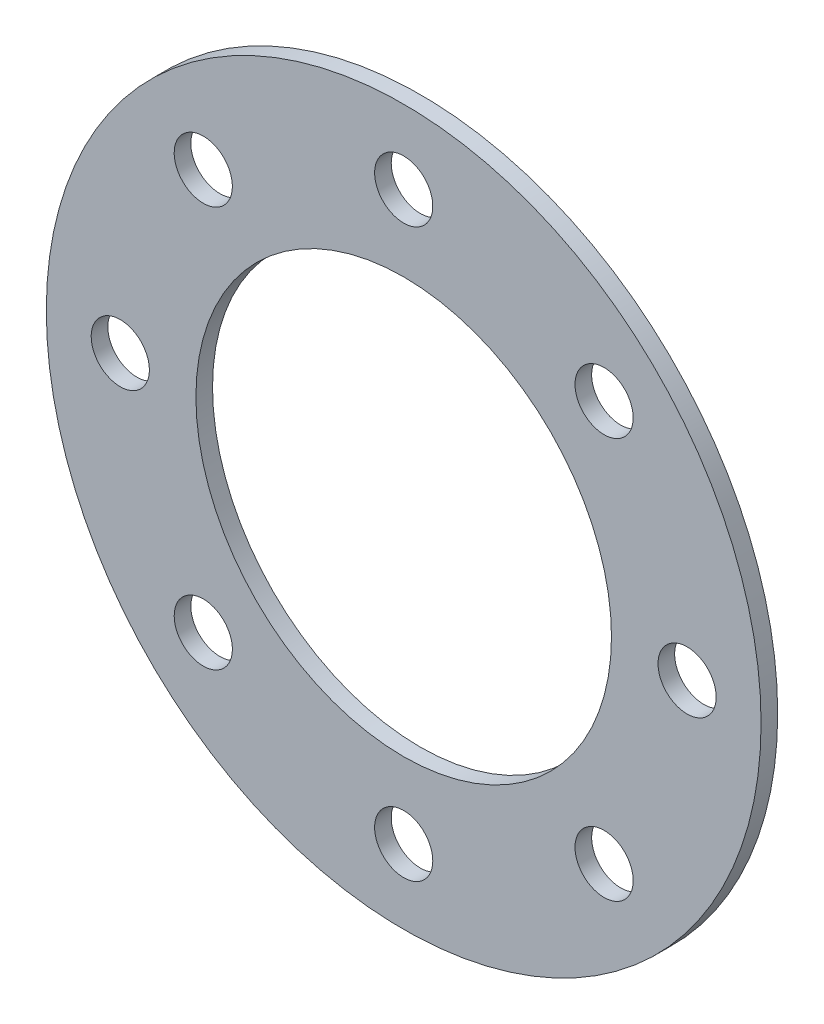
from build123d import *

# Parameters (mm, degrees)
CROQUIS1_R              = 43
CROQUIS1_R_2            = 25
SALIENTE_EXTRUIR1_DEPTH = 2
CROQUIS2_R              = 3.5
CORTAR_EXTRUIR1_DEPTH   = 2
MATRIZC1_COUNT          = 8


with BuildPart() as part:
    # Croquis1 → Saliente-Extruir1 (new body)
    with BuildSketch(Plane.XY):
        Circle(CROQUIS1_R)
        Circle(CROQUIS1_R_2, mode=Mode.SUBTRACT)
    extrude(amount=SALIENTE_EXTRUIR1_DEPTH)

    # Croquis2 → Cortar-Extruir1 (cut)
    with BuildSketch(Plane(origin=(0, 0, 0), x_dir=(-1, 0, 0), z_dir=(0, 0, -1))):
        with Locations((0, 34.1)):
            Circle(CROQUIS2_R)
    cortar_extruir1 = extrude(amount=-CORTAR_EXTRUIR1_DEPTH, mode=Mode.SUBTRACT)

    # MatrizC1: Cortar-Extruir1 ×8 about axis
    matrizc1_axis = Axis((0, 0, 0), (0, 0, 1))
    for i in range(1, MATRIZC1_COUNT):
        add(cortar_extruir1.rotate(matrizc1_axis, i * 360 / MATRIZC1_COUNT), mode=Mode.SUBTRACT)


solid = part.part
